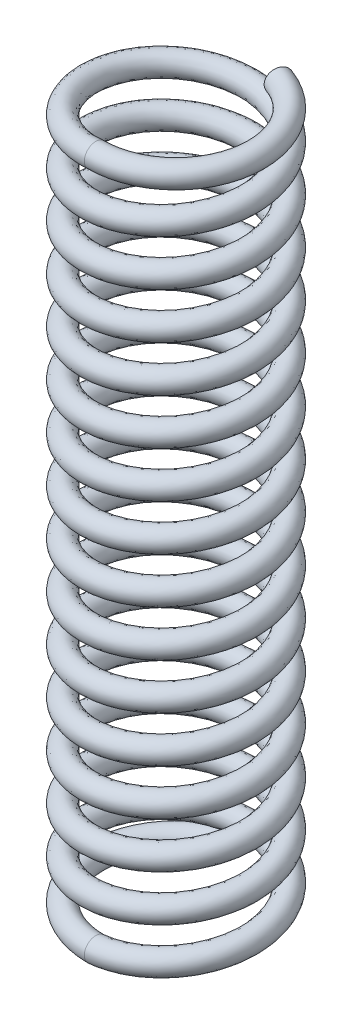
from build123d import *

# Parameters (mm, degrees)
BALAYAGE1_PITCH   = 2
BALAYAGE1_HEIGHT  = 30
BALAYAGE1_RADIUS  = 3.5
ESQUISSE2_R       = 0.5
ESQUISSE3_R       = 0.5
SPIRE_BASSE_ANGLE = 160
ESQUISSE4_R       = 0.5
SPIRE_HAUTE_ANGLE = 160


with BuildPart() as part:
    # Balayage1: sweep along a helix
    with BuildLine() as balayage1_path:
        Helix(BALAYAGE1_PITCH, BALAYAGE1_HEIGHT, BALAYAGE1_RADIUS, center=(0, 0, 0), direction=(0, 1, 0))
    # Esquisse2 → Balayage1 (sweep)
    with BuildSketch(Plane(origin=(0, 0, 0), x_dir=(0, 0, -1), z_dir=(1, 0, 0))):
        with Locations((-3.5, 0)):
            Circle(ESQUISSE2_R)
    sweep(path=balayage1_path.line, is_frenet=True)

    # Esquisse3 → Spire basse (revolve)
    with BuildSketch(Plane(origin=(0, 0, 0), x_dir=(0, 0, -1), z_dir=(1, 0, 0))):
        with Locations((-3.5, 0)):
            Circle(ESQUISSE3_R)
    revolve(axis=Axis((0, 0, 0), (0, -1, 0)), revolution_arc=SPIRE_BASSE_ANGLE)

    # Esquisse4 → Spire haute (revolve)
    with BuildSketch(Plane(origin=(0, 0, 0), x_dir=(0, 0, -1), z_dir=(1, 0, 0))):
        with Locations((-3.5, 30)):
            Circle(ESQUISSE4_R)
    revolve(axis=Axis((0, 56.839262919, 0), (0, 1, 0)), revolution_arc=SPIRE_HAUTE_ANGLE)


solid = part.part
